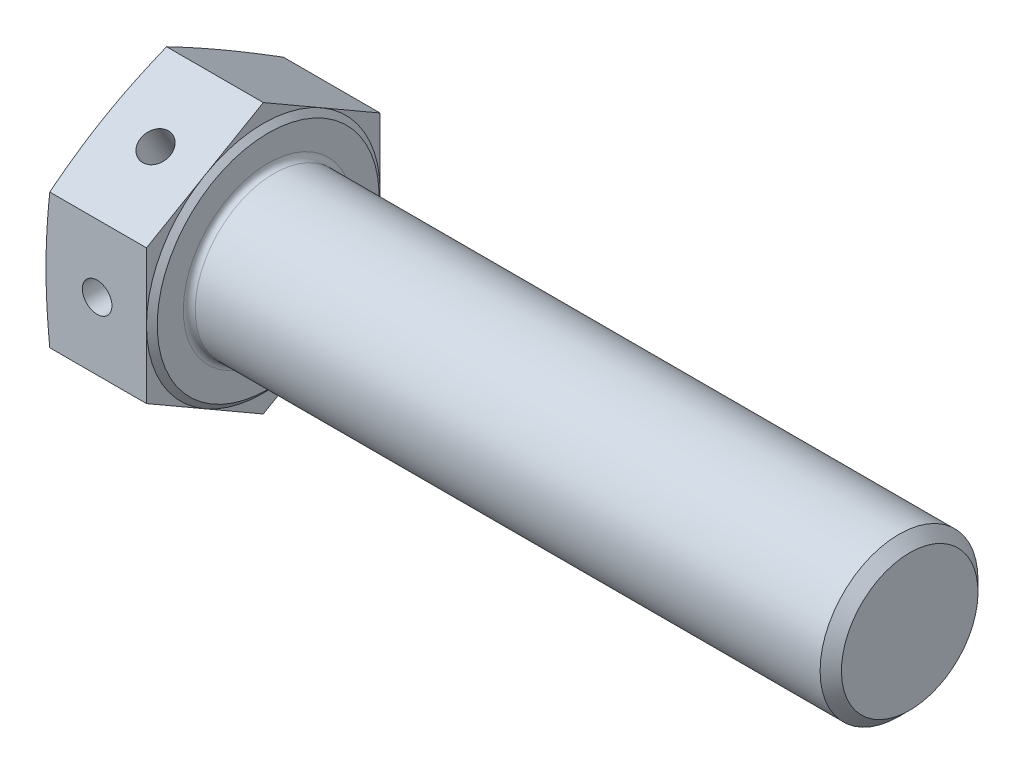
ISO-10303-21;
HEADER;
FILE_DESCRIPTION(('STEP AP214'),'2;1');
FILE_NAME('part.step','',(''),(''),'','','');
FILE_SCHEMA(('AUTOMOTIVE_DESIGN { 1 0 10303 214 1 1 1 1 }'));
ENDSEC;
DATA;
#1=APPLICATION_CONTEXT('core data for automotive mechanical design processes');
#2=APPLICATION_PROTOCOL_DEFINITION('international standard','automotive_design',2000,#1);
#3=PRODUCT_CONTEXT('',#1,'mechanical');
#4=PRODUCT('Part','Part','',(#3));
#5=PRODUCT_RELATED_PRODUCT_CATEGORY('part','',(#4));
#6=PRODUCT_DEFINITION_FORMATION('','',#4);
#7=PRODUCT_DEFINITION_CONTEXT('part definition',#1,'design');
#8=PRODUCT_DEFINITION('design','',#6,#7);
#9=PRODUCT_DEFINITION_SHAPE('','',#8);
#10=(LENGTH_UNIT() NAMED_UNIT(*) SI_UNIT(.MILLI.,.METRE.));
#11=(NAMED_UNIT(*) PLANE_ANGLE_UNIT() SI_UNIT($,.RADIAN.));
#12=(NAMED_UNIT(*) SI_UNIT($,.STERADIAN.) SOLID_ANGLE_UNIT());
#13=UNCERTAINTY_MEASURE_WITH_UNIT(LENGTH_MEASURE(1.E-05),#10,'distance_accuracy_value','');
#14=(GEOMETRIC_REPRESENTATION_CONTEXT(3) GLOBAL_UNCERTAINTY_ASSIGNED_CONTEXT((#13)) GLOBAL_UNIT_ASSIGNED_CONTEXT((#10,
#11,#12)) REPRESENTATION_CONTEXT('',''));
#15=CARTESIAN_POINT('',(0.,0.,0.));
#16=DIRECTION('',(0.,0.,1.));
#17=DIRECTION('',(1.,0.,0.));
#18=AXIS2_PLACEMENT_3D('',#15,#16,#17);
#19=CARTESIAN_POINT('',(5.18,0.,-11.835));
#20=DIRECTION('',(0.,0.,1.));
#21=DIRECTION('',(1.,0.,0.));
#22=AXIS2_PLACEMENT_3D('',#19,#20,#21);
#23=CYLINDRICAL_SURFACE('',#22,1.5);
#24=CARTESIAN_POINT('',(5.18,0.,11.835));
#25=DIRECTION('',(0.,0.,1.));
#26=DIRECTION('',(1.,0.,0.));
#27=AXIS2_PLACEMENT_3D('',#24,#25,#26);
#28=CIRCLE('',#27,1.5);
#29=CARTESIAN_POINT('',(6.68,0.,11.835));
#30=VERTEX_POINT('',#29);
#31=EDGE_CURVE('E584',#30,#30,#28,.T.);
#32=ORIENTED_EDGE('',*,*,#31,.T.);
#33=EDGE_LOOP('',(#32));
#34=FACE_BOUND('',#33,.T.);
#35=CARTESIAN_POINT('',(5.18,0.,0.));
#36=DIRECTION('',(0.,-0.866025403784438,0.500000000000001));
#37=DIRECTION('',(0.,0.500000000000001,0.866025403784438));
#38=AXIS2_PLACEMENT_3D('',#35,#36,#37);
#39=ELLIPSE('',#38,3.,1.5);
#40=CARTESIAN_POINT('',(3.68,0.,0.));
#41=VERTEX_POINT('',#40);
#42=CARTESIAN_POINT('',(6.68,0.,0.));
#43=VERTEX_POINT('',#42);
#44=EDGE_CURVE('E46',#41,#43,#39,.F.);
#45=ORIENTED_EDGE('',*,*,#44,.T.);
#46=CARTESIAN_POINT('',(5.18,0.,0.));
#47=DIRECTION('',(0.,0.500000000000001,0.866025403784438));
#48=DIRECTION('',(0.,-0.866025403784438,0.500000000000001));
#49=AXIS2_PLACEMENT_3D('',#46,#47,#48);
#50=ELLIPSE('',#49,1.73205080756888,1.5);
#51=EDGE_CURVE('E11',#43,#41,#50,.F.);
#52=ORIENTED_EDGE('',*,*,#51,.T.);
#53=EDGE_LOOP('',(#45,#52));
#54=FACE_BOUND('',#53,.T.);
#55=ADVANCED_FACE('F32',(#34,#54),#23,.F.);
#56=CARTESIAN_POINT('',(10.68,0.,0.));
#57=DIRECTION('',(-1.,0.,0.));
#58=DIRECTION('',(0.,-1.,0.));
#59=AXIS2_PLACEMENT_3D('',#56,#57,#58);
#60=PLANE('',#59);
#61=CARTESIAN_POINT('',(10.68,0.,0.));
#62=DIRECTION('',(-1.,0.,0.));
#63=DIRECTION('',(0.,-1.,0.));
#64=AXIS2_PLACEMENT_3D('',#61,#62,#63);
#65=CIRCLE('',#64,8.6);
#66=CARTESIAN_POINT('',(10.68,-8.6,0.));
#67=VERTEX_POINT('',#66);
#68=EDGE_CURVE('E137',#67,#67,#65,.T.);
#69=ORIENTED_EDGE('',*,*,#68,.T.);
#70=EDGE_LOOP('',(#69));
#71=FACE_BOUND('',#70,.T.);
#72=CARTESIAN_POINT('',(10.68,0.,0.));
#73=DIRECTION('',(-1.,0.,0.));
#74=DIRECTION('',(0.,-1.,0.));
#75=AXIS2_PLACEMENT_3D('',#72,#73,#74);
#76=CIRCLE('',#75,11.245);
#77=CARTESIAN_POINT('',(10.68,-11.245,0.));
#78=VERTEX_POINT('',#77);
#79=EDGE_CURVE('E284',#78,#78,#76,.T.);
#80=ORIENTED_EDGE('',*,*,#79,.F.);
#81=EDGE_LOOP('',(#80));
#82=FACE_BOUND('',#81,.T.);
#83=ADVANCED_FACE('F239',(#71,#82),#60,.F.);
#84=CARTESIAN_POINT('',(10.18,-20.4988213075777,-11.835));
#85=DIRECTION('',(1.,0.,0.));
#86=DIRECTION('',(0.,0.,-1.));
#87=AXIS2_PLACEMENT_3D('',#84,#85,#86);
#88=PLANE('',#87);
#89=DIRECTION('',(0.,-0.5,-0.866025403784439));
#90=VECTOR('',#89,1.);
#91=CARTESIAN_POINT('',(10.18,-6.83294043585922,11.835));
#92=LINE('',#91,#90);
#93=CARTESIAN_POINT('',(10.18,-6.83294043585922,11.835));
#94=VERTEX_POINT('',#93);
#95=CARTESIAN_POINT('',(10.18,-10.2494106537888,5.9175));
#96=VERTEX_POINT('',#95);
#97=EDGE_CURVE('E197',#94,#96,#92,.T.);
#98=ORIENTED_EDGE('',*,*,#97,.T.);
#99=CARTESIAN_POINT('',(10.18,0.,0.));
#100=DIRECTION('',(-1.,0.,0.));
#101=DIRECTION('',(0.,-1.,0.));
#102=AXIS2_PLACEMENT_3D('',#99,#100,#101);
#103=CIRCLE('',#102,11.835);
#104=CARTESIAN_POINT('',(10.18,0.,11.835));
#105=VERTEX_POINT('',#104);
#106=EDGE_CURVE('E54',#96,#105,#103,.T.);
#107=ORIENTED_EDGE('',*,*,#106,.T.);
#108=DIRECTION('',(0.,-1.,0.));
#109=VECTOR('',#108,1.);
#110=CARTESIAN_POINT('',(10.18,6.83294043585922,11.835));
#111=LINE('',#110,#109);
#112=EDGE_CURVE('E180',#105,#94,#111,.T.);
#113=ORIENTED_EDGE('',*,*,#112,.T.);
#114=EDGE_LOOP('',(#98,#107,#113));
#115=FACE_BOUND('',#114,.T.);
#116=ADVANCED_FACE('F245',(#115),#88,.T.);
#117=CARTESIAN_POINT('',(10.18,6.83294043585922,11.835));
#118=VERTEX_POINT('',#117);
#119=EDGE_CURVE('E177',#118,#105,#111,.T.);
#120=ORIENTED_EDGE('',*,*,#119,.T.);
#121=CARTESIAN_POINT('',(10.18,10.2494106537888,5.9175));
#122=VERTEX_POINT('',#121);
#123=EDGE_CURVE('E153',#105,#122,#103,.T.);
#124=ORIENTED_EDGE('',*,*,#123,.T.);
#125=DIRECTION('',(0.,-0.5,0.866025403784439));
#126=VECTOR('',#125,1.);
#127=CARTESIAN_POINT('',(10.18,13.6658808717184,0.));
#128=LINE('',#127,#126);
#129=EDGE_CURVE('E184',#122,#118,#128,.T.);
#130=ORIENTED_EDGE('',*,*,#129,.T.);
#131=EDGE_LOOP('',(#120,#124,#130));
#132=FACE_BOUND('',#131,.T.);
#133=ADVANCED_FACE('F341',(#132),#88,.T.);
#134=CARTESIAN_POINT('',(10.18,13.6658808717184,0.));
#135=VERTEX_POINT('',#134);
#136=EDGE_CURVE('E181',#135,#122,#128,.T.);
#137=ORIENTED_EDGE('',*,*,#136,.T.);
#138=CARTESIAN_POINT('',(10.18,10.2494106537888,-5.9175));
#139=VERTEX_POINT('',#138);
#140=EDGE_CURVE('E346',#122,#139,#103,.T.);
#141=ORIENTED_EDGE('',*,*,#140,.T.);
#142=DIRECTION('',(0.,0.5,0.866025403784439));
#143=VECTOR('',#142,1.);
#144=CARTESIAN_POINT('',(10.18,6.83294043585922,-11.835));
#145=LINE('',#144,#143);
#146=EDGE_CURVE('E188',#139,#135,#145,.T.);
#147=ORIENTED_EDGE('',*,*,#146,.T.);
#148=EDGE_LOOP('',(#137,#141,#147));
#149=FACE_BOUND('',#148,.T.);
#150=ADVANCED_FACE('F345',(#149),#88,.T.);
#151=CARTESIAN_POINT('',(10.18,6.83294043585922,-11.835));
#152=VERTEX_POINT('',#151);
#153=EDGE_CURVE('E185',#152,#139,#145,.T.);
#154=ORIENTED_EDGE('',*,*,#153,.T.);
#155=CARTESIAN_POINT('',(10.18,0.,-11.835));
#156=VERTEX_POINT('',#155);
#157=EDGE_CURVE('E405',#139,#156,#103,.T.);
#158=ORIENTED_EDGE('',*,*,#157,.T.);
#159=DIRECTION('',(0.,1.,0.));
#160=VECTOR('',#159,1.);
#161=CARTESIAN_POINT('',(10.18,-6.83294043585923,-11.835));
#162=LINE('',#161,#160);
#163=EDGE_CURVE('E192',#156,#152,#162,.T.);
#164=ORIENTED_EDGE('',*,*,#163,.T.);
#165=EDGE_LOOP('',(#154,#158,#164));
#166=FACE_BOUND('',#165,.T.);
#167=ADVANCED_FACE('F398',(#166),#88,.T.);
#168=CARTESIAN_POINT('',(10.18,-6.83294043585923,-11.835));
#169=VERTEX_POINT('',#168);
#170=EDGE_CURVE('E189',#169,#156,#162,.T.);
#171=ORIENTED_EDGE('',*,*,#170,.T.);
#172=CARTESIAN_POINT('',(10.18,-10.2494106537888,-5.9175));
#173=VERTEX_POINT('',#172);
#174=EDGE_CURVE('E403',#156,#173,#103,.T.);
#175=ORIENTED_EDGE('',*,*,#174,.T.);
#176=DIRECTION('',(0.,0.5,-0.866025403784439));
#177=VECTOR('',#176,1.);
#178=CARTESIAN_POINT('',(10.18,-13.6658808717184,0.));
#179=LINE('',#178,#177);
#180=EDGE_CURVE('E196',#173,#169,#179,.T.);
#181=ORIENTED_EDGE('',*,*,#180,.T.);
#182=EDGE_LOOP('',(#171,#175,#181));
#183=FACE_BOUND('',#182,.T.);
#184=ADVANCED_FACE('F393',(#183),#88,.T.);
#185=CARTESIAN_POINT('',(10.18,-13.6658808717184,0.));
#186=VERTEX_POINT('',#185);
#187=EDGE_CURVE('E193',#186,#173,#179,.T.);
#188=ORIENTED_EDGE('',*,*,#187,.T.);
#189=EDGE_CURVE('E292',#173,#96,#103,.T.);
#190=ORIENTED_EDGE('',*,*,#189,.T.);
#191=EDGE_CURVE('E200',#96,#186,#92,.T.);
#192=ORIENTED_EDGE('',*,*,#191,.T.);
#193=EDGE_LOOP('',(#188,#190,#192));
#194=FACE_BOUND('',#193,.T.);
#195=ADVANCED_FACE('F234',(#194),#88,.T.);
#196=CARTESIAN_POINT('',(10.18,-6.83294043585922,11.835));
#197=DIRECTION('',(0.,0.866025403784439,-0.5));
#198=DIRECTION('',(0.,0.5,0.866025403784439));
#199=AXIS2_PLACEMENT_3D('',#196,#197,#198);
#200=PLANE('',#199);
#201=CARTESIAN_POINT('',(0.38368252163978,-13.6659963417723,-0.000199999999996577));
#202=CARTESIAN_POINT('',(0.324118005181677,-13.3818649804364,0.491929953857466));
#203=CARTESIAN_POINT('',(0.270094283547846,-13.0974164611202,0.984609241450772));
#204=CARTESIAN_POINT('',(0.175240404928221,-12.527904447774,1.97103298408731));
#205=CARTESIAN_POINT('',(0.134413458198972,-12.2428408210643,2.46477766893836));
#206=CARTESIAN_POINT('',(0.068201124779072,-11.6731595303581,3.4514946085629));
#207=CARTESIAN_POINT('',(0.04276725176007,-11.3885433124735,3.94446435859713));
#208=CARTESIAN_POINT('',(0.00866765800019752,-10.8190882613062,4.93078943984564));
#209=CARTESIAN_POINT('',(0.,-10.5342494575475,5.42414471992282));
#210=CARTESIAN_POINT('',(0.,-9.96457185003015,6.41085528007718));
#211=CARTESIAN_POINT('',(0.00866765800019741,-9.67973304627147,6.90421056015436));
#212=CARTESIAN_POINT('',(0.0427672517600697,-9.11027799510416,7.89053564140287));
#213=CARTESIAN_POINT('',(0.0682011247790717,-8.82566177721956,8.3835053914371));
#214=CARTESIAN_POINT('',(0.134413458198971,-8.25598048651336,9.37022233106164));
#215=CARTESIAN_POINT('',(0.17524040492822,-7.97091685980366,9.86396701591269));
#216=CARTESIAN_POINT('',(0.270094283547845,-7.40140484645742,10.8503907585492));
#217=CARTESIAN_POINT('',(0.324118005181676,-7.11695632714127,11.3430700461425));
#218=CARTESIAN_POINT('',(0.383682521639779,-6.83282496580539,11.8352));
#219=B_SPLINE_CURVE_WITH_KNOTS('',3,(#201,#202,#203,#204,#205,#206,#207,#208,#209,#210,#211,
#212,#213,#214,#215,#216,#217,#218),.UNSPECIFIED.,.F.,.F.,(4,2,2,2,2,2,2,2,4),(0.,
1.71418095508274,3.4287785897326,5.13794695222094,6.84691781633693,8.55588868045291,
10.2650570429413,11.9796546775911,13.6938356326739),.UNSPECIFIED.);
#220=CARTESIAN_POINT('',(0.383658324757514,-13.6658808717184,0.));
#221=VERTEX_POINT('',#220);
#222=CARTESIAN_POINT('',(0.,-10.2494106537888,5.91749999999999));
#223=VERTEX_POINT('',#222);
#224=EDGE_CURVE('E356',#221,#223,#219,.T.);
#225=ORIENTED_EDGE('',*,*,#224,.F.);
#226=DIRECTION('',(-1.,0.,0.));
#227=VECTOR('',#226,1.);
#228=CARTESIAN_POINT('',(10.18,-13.6658808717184,0.));
#229=LINE('',#228,#227);
#230=EDGE_CURVE('E158',#186,#221,#229,.T.);
#231=ORIENTED_EDGE('',*,*,#230,.F.);
#232=ORIENTED_EDGE('',*,*,#191,.F.);
#233=ORIENTED_EDGE('',*,*,#97,.F.);
#234=DIRECTION('',(-1.,0.,0.));
#235=VECTOR('',#234,1.);
#236=CARTESIAN_POINT('',(10.18,-6.83294043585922,11.835));
#237=LINE('',#236,#235);
#238=CARTESIAN_POINT('',(0.383658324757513,-6.83294043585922,11.835));
#239=VERTEX_POINT('',#238);
#240=EDGE_CURVE('E174',#94,#239,#237,.T.);
#241=ORIENTED_EDGE('',*,*,#240,.T.);
#242=EDGE_CURVE('E333',#223,#239,#219,.T.);
#243=ORIENTED_EDGE('',*,*,#242,.F.);
#244=EDGE_LOOP('',(#225,#231,#232,#233,#241,#243));
#245=FACE_BOUND('',#244,.T.);
#246=ADVANCED_FACE('F34',(#245),#200,.F.);
#247=CARTESIAN_POINT('',(10.18,-13.6658808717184,0.));
#248=DIRECTION('',(0.,0.866025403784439,0.5));
#249=DIRECTION('',(0.,-0.5,0.866025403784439));
#250=AXIS2_PLACEMENT_3D('',#247,#248,#249);
#251=PLANE('',#250);
#252=CARTESIAN_POINT('',(5.18,-10.2494106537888,-5.91749999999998));
#253=DIRECTION('',(0.,0.866025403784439,0.5));
#254=DIRECTION('',(0.,-0.5,0.866025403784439));
#255=AXIS2_PLACEMENT_3D('',#252,#253,#254);
#256=CIRCLE('',#255,1.5);
#257=CARTESIAN_POINT('',(5.18,-10.9994106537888,-4.61846189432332));
#258=VERTEX_POINT('',#257);
#259=EDGE_CURVE('E582',#258,#258,#256,.T.);
#260=ORIENTED_EDGE('',*,*,#259,.T.);
#261=EDGE_LOOP('',(#260));
#262=FACE_BOUND('',#261,.T.);
#263=CARTESIAN_POINT('',(0.383682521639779,-6.83282496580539,-11.8352));
#264=CARTESIAN_POINT('',(0.324118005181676,-7.11695632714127,-11.3430700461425));
#265=CARTESIAN_POINT('',(0.270094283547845,-7.40140484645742,-10.8503907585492));
#266=CARTESIAN_POINT('',(0.17524040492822,-7.97091685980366,-9.86396701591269));
#267=CARTESIAN_POINT('',(0.134413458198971,-8.25598048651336,-9.37022233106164));
#268=CARTESIAN_POINT('',(0.0682011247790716,-8.82566177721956,-8.3835053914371));
#269=CARTESIAN_POINT('',(0.0427672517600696,-9.11027799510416,-7.89053564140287));
#270=CARTESIAN_POINT('',(0.00866765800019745,-9.67973304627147,-6.90421056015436));
#271=CARTESIAN_POINT('',(0.,-9.96457185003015,-6.41085528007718));
#272=CARTESIAN_POINT('',(0.,-10.5342494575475,-5.42414471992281));
#273=CARTESIAN_POINT('',(0.00866765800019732,-10.8190882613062,-4.93078943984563));
#274=CARTESIAN_POINT('',(0.0427672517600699,-11.3885433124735,-3.94446435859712));
#275=CARTESIAN_POINT('',(0.0682011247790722,-11.6731595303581,-3.45149460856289));
#276=CARTESIAN_POINT('',(0.134413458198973,-12.2428408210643,-2.46477766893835));
#277=CARTESIAN_POINT('',(0.175240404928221,-12.527904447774,-1.9710329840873));
#278=CARTESIAN_POINT('',(0.270094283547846,-13.0974164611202,-0.984609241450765));
#279=CARTESIAN_POINT('',(0.324118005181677,-13.3818649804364,-0.491929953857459));
#280=CARTESIAN_POINT('',(0.38368252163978,-13.6659963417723,0.000200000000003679));
#281=B_SPLINE_CURVE_WITH_KNOTS('',3,(#263,#264,#265,#266,#267,#268,#269,#270,#271,#272,#273,
#274,#275,#276,#277,#278,#279,#280),.UNSPECIFIED.,.F.,.F.,(4,2,2,2,2,2,2,2,4),(0.,
1.71418095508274,3.4287785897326,5.13794695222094,6.84691781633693,8.55588868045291,
10.2650570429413,11.9796546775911,13.6938356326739),.UNSPECIFIED.);
#282=CARTESIAN_POINT('',(0.383658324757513,-6.83294043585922,-11.835));
#283=VERTEX_POINT('',#282);
#284=CARTESIAN_POINT('',(0.,-10.2494106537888,-5.9175));
#285=VERTEX_POINT('',#284);
#286=EDGE_CURVE('E355',#283,#285,#281,.T.);
#287=ORIENTED_EDGE('',*,*,#286,.F.);
#288=DIRECTION('',(-1.,0.,0.));
#289=VECTOR('',#288,1.);
#290=CARTESIAN_POINT('',(10.18,-6.83294043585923,-11.835));
#291=LINE('',#290,#289);
#292=EDGE_CURVE('E162',#169,#283,#291,.T.);
#293=ORIENTED_EDGE('',*,*,#292,.F.);
#294=ORIENTED_EDGE('',*,*,#180,.F.);
#295=ORIENTED_EDGE('',*,*,#187,.F.);
#296=ORIENTED_EDGE('',*,*,#230,.T.);
#297=EDGE_CURVE('E210',#285,#221,#281,.T.);
#298=ORIENTED_EDGE('',*,*,#297,.F.);
#299=EDGE_LOOP('',(#287,#293,#294,#295,#296,#298));
#300=FACE_BOUND('',#299,.T.);
#301=ADVANCED_FACE('F224',(#262,#300),#251,.F.);
#302=CARTESIAN_POINT('',(10.18,-6.83294043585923,-11.835));
#303=DIRECTION('',(0.,0.,1.));
#304=DIRECTION('',(0.,-1.,0.));
#305=AXIS2_PLACEMENT_3D('',#302,#303,#304);
#306=PLANE('',#305);
#307=CARTESIAN_POINT('',(5.18,0.,-11.835));
#308=DIRECTION('',(0.,0.,1.));
#309=DIRECTION('',(1.,0.,0.));
#310=AXIS2_PLACEMENT_3D('',#307,#308,#309);
#311=CIRCLE('',#310,1.5);
#312=CARTESIAN_POINT('',(6.68,0.,-11.835));
#313=VERTEX_POINT('',#312);
#314=EDGE_CURVE('E290',#313,#313,#311,.T.);
#315=ORIENTED_EDGE('',*,*,#314,.T.);
#316=EDGE_LOOP('',(#315));
#317=FACE_BOUND('',#316,.T.);
#318=CARTESIAN_POINT('',(2.04291441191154,-18.0501307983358,-11.835));
#319=CARTESIAN_POINT('',(1.94882996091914,-17.5130968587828,-11.835));
#320=CARTESIAN_POINT('',(1.85592371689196,-16.9758527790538,-11.835));
#321=CARTESIAN_POINT('',(1.67309508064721,-15.9008428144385,-11.835));
#322=CARTESIAN_POINT('',(1.58317276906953,-15.3630769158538,-11.835));
#323=CARTESIAN_POINT('',(1.40689155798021,-14.2866269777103,-11.835));
#324=CARTESIAN_POINT('',(1.32053483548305,-13.7479425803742,-11.835));
#325=CARTESIAN_POINT('',(1.15228280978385,-12.6698779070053,-11.835));
#326=CARTESIAN_POINT('',(1.07038748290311,-12.1304976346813,-11.835));
#327=CARTESIAN_POINT('',(0.912478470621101,-11.0535029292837,-11.835));
#328=CARTESIAN_POINT('',(0.836438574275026,-10.5158923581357,-11.835));
#329=CARTESIAN_POINT('',(0.691087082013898,-9.4397639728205,-11.835));
#330=CARTESIAN_POINT('',(0.621775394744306,-8.90124617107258,-11.835));
#331=CARTESIAN_POINT('',(0.491422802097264,-7.8232453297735,-11.835));
#332=CARTESIAN_POINT('',(0.43038124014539,-7.28376237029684,-11.835));
#333=CARTESIAN_POINT('',(0.318338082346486,-6.20374352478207,-11.835));
#334=CARTESIAN_POINT('',(0.267336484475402,-5.66320763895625,-11.835));
#335=CARTESIAN_POINT('',(0.176973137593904,-4.57747867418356,-11.835));
#336=CARTESIAN_POINT('',(0.137692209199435,-4.03227877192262,-11.835));
#337=CARTESIAN_POINT('',(0.0730761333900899,-2.94104599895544,-11.835));
#338=CARTESIAN_POINT('',(0.0477408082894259,-2.39501313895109,-11.835));
#339=CARTESIAN_POINT('',(0.0124139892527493,-1.30258571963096,-11.835));
#340=CARTESIAN_POINT('',(0.00241845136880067,-0.756191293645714,-11.835));
#341=CARTESIAN_POINT('',(-0.00163941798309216,0.336657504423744,-11.835));
#342=CARTESIAN_POINT('',(0.00429823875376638,0.883111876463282,-11.835));
#343=CARTESIAN_POINT('',(0.0317757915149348,1.97683171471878,-11.835));
#344=CARTESIAN_POINT('',(0.0533502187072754,2.5240962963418,-11.835));
#345=CARTESIAN_POINT('',(0.110911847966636,3.617859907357,-11.835));
#346=CARTESIAN_POINT('',(0.146899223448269,4.16435892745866,-11.835));
#347=CARTESIAN_POINT('',(0.231529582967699,5.25656682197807,-11.835));
#348=CARTESIAN_POINT('',(0.280177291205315,5.80227532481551,-11.835));
#349=CARTESIAN_POINT('',(0.388164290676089,6.89262217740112,-11.835));
#350=CARTESIAN_POINT('',(0.447503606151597,7.43726052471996,-11.835));
#351=CARTESIAN_POINT('',(0.571239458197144,8.49335727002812,-11.835));
#352=CARTESIAN_POINT('',(0.635130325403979,9.00487550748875,-11.835));
#353=CARTESIAN_POINT('',(0.769351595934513,10.0270706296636,-11.835));
#354=CARTESIAN_POINT('',(0.839682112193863,10.5377474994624,-11.835));
#355=CARTESIAN_POINT('',(0.985624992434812,11.5583763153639,-11.835));
#356=CARTESIAN_POINT('',(1.06123770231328,12.0683282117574,-11.835));
#357=CARTESIAN_POINT('',(1.21678601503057,13.0875668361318,-11.835));
#358=CARTESIAN_POINT('',(1.29672159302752,13.5968535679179,-11.835));
#359=CARTESIAN_POINT('',(1.46015698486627,14.6149521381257,-11.835));
#360=CARTESIAN_POINT('',(1.54365747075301,15.1237638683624,-11.835));
#361=CARTESIAN_POINT('',(1.7135915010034,16.1408980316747,-11.835));
#362=CARTESIAN_POINT('',(1.80002505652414,16.6492204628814,-11.835));
#363=CARTESIAN_POINT('',(2.06294205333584,18.173518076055,-11.835));
#364=CARTESIAN_POINT('',(2.24304905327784,19.1888680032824,-11.835));
#365=CARTESIAN_POINT('',(2.60890933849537,21.2122527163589,-11.835));
#366=CARTESIAN_POINT('',(2.7946222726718,22.2202948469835,-11.835));
#367=CARTESIAN_POINT('',(3.17087970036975,24.2354876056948,-11.835));
#368=CARTESIAN_POINT('',(3.36142425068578,25.242638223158,-11.835));
#369=CARTESIAN_POINT('',(3.74592520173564,27.2554087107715,-11.835));
#370=CARTESIAN_POINT('',(3.93987859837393,28.2610291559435,-11.835));
#371=CARTESIAN_POINT('',(4.23283790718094,29.7690539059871,-11.835));
#372=CARTESIAN_POINT('',(4.33082817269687,30.2716558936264,-11.835));
#373=CARTESIAN_POINT('',(4.52740724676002,31.2767424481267,-11.835));
#374=CARTESIAN_POINT('',(4.62599605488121,31.7792270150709,-11.835));
#375=CARTESIAN_POINT('',(4.72484494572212,32.2816604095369,-11.835));
#376=B_SPLINE_CURVE_WITH_KNOTS('',3,(#318,#319,#320,#321,#322,#323,#324,#325,#326,#327,#328,
#329,#330,#331,#332,#333,#334,#335,#336,#337,#338,#339,#340,#341,#342,#343,#344,#345,#346,#347,
#348,#349,#350,#351,#352,#353,#354,#355,#356,#357,#358,#359,#360,#361,#362,#363,#364,#365,#366,
#367,#368,#369,#370,#371,#372,#373,#374,#375),.UNSPECIFIED.,.F.,.F.,(4,2,2,2,2,2,2,2,2,2,2,2,2,
2,2,2,2,2,2,2,2,2,2,2,2,2,2,2,4),(0.,1.63564351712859,3.27133120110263,4.90800323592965,
6.54466658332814,8.17351699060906,9.80234527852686,11.4310441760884,13.0597427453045,
14.6994255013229,16.3390873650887,17.9783168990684,19.6175452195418,21.2604045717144,
22.9032836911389,24.5467767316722,26.1902734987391,27.7367040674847,29.2831617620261,
30.8297208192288,32.3762709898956,33.9231140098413,35.4699629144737,38.5635257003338,
41.6385312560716,44.7135729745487,47.7860286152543,49.3222241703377,50.8584186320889),.UNSPECIFIED.);
#377=CARTESIAN_POINT('',(0.383658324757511,6.83294043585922,-11.835));
#378=VERTEX_POINT('',#377);
#379=CARTESIAN_POINT('',(0.,0.,-11.835));
#380=VERTEX_POINT('',#379);
#381=EDGE_CURVE('E208',#378,#380,#376,.F.);
#382=ORIENTED_EDGE('',*,*,#381,.F.);
#383=DIRECTION('',(-1.,0.,0.));
#384=VECTOR('',#383,1.);
#385=CARTESIAN_POINT('',(10.18,6.83294043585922,-11.835));
#386=LINE('',#385,#384);
#387=EDGE_CURVE('E165',#152,#378,#386,.T.);
#388=ORIENTED_EDGE('',*,*,#387,.F.);
#389=ORIENTED_EDGE('',*,*,#163,.F.);
#390=ORIENTED_EDGE('',*,*,#170,.F.);
#391=ORIENTED_EDGE('',*,*,#292,.T.);
#392=EDGE_CURVE('E201',#380,#283,#376,.F.);
#393=ORIENTED_EDGE('',*,*,#392,.F.);
#394=EDGE_LOOP('',(#382,#388,#389,#390,#391,#393));
#395=FACE_BOUND('',#394,.T.);
#396=ADVANCED_FACE('F219',(#317,#395),#306,.F.);
#397=CARTESIAN_POINT('',(10.18,6.83294043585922,-11.835));
#398=DIRECTION('',(0.,-0.866025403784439,0.5));
#399=DIRECTION('',(0.,-0.5,-0.866025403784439));
#400=AXIS2_PLACEMENT_3D('',#397,#398,#399);
#401=PLANE('',#400);
#402=CARTESIAN_POINT('',(0.383682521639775,13.6659963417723,0.000199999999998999));
#403=CARTESIAN_POINT('',(0.324118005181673,13.3818649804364,-0.491929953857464));
#404=CARTESIAN_POINT('',(0.270094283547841,13.0974164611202,-0.98460924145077));
#405=CARTESIAN_POINT('',(0.175240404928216,12.527904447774,-1.97103298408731));
#406=CARTESIAN_POINT('',(0.134413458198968,12.2428408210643,-2.46477766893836));
#407=CARTESIAN_POINT('',(0.0682011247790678,11.6731595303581,-3.4514946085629));
#408=CARTESIAN_POINT('',(0.042767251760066,11.3885433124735,-3.94446435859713));
#409=CARTESIAN_POINT('',(0.00866765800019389,10.8190882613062,-4.93078943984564));
#410=CARTESIAN_POINT('',(0.,10.5342494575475,-5.42414471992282));
#411=CARTESIAN_POINT('',(0.,9.96457185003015,-6.41085528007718));
#412=CARTESIAN_POINT('',(0.00866765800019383,9.67973304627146,-6.90421056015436));
#413=CARTESIAN_POINT('',(0.0427672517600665,9.11027799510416,-7.89053564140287));
#414=CARTESIAN_POINT('',(0.0682011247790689,8.82566177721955,-8.3835053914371));
#415=CARTESIAN_POINT('',(0.134413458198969,8.25598048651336,-9.37022233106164));
#416=CARTESIAN_POINT('',(0.175240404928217,7.97091685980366,-9.86396701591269));
#417=CARTESIAN_POINT('',(0.270094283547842,7.40140484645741,-10.8503907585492));
#418=CARTESIAN_POINT('',(0.324118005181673,7.11695632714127,-11.3430700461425));
#419=CARTESIAN_POINT('',(0.383682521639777,6.83282496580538,-11.8352));
#420=B_SPLINE_CURVE_WITH_KNOTS('',3,(#402,#403,#404,#405,#406,#407,#408,#409,#410,#411,#412,
#413,#414,#415,#416,#417,#418,#419),.UNSPECIFIED.,.F.,.F.,(4,2,2,2,2,2,2,2,4),(0.,
1.71418095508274,3.4287785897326,5.13794695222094,6.84691781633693,8.55588868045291,
10.2650570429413,11.9796546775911,13.6938356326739),.UNSPECIFIED.);
#421=CARTESIAN_POINT('',(0.38365832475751,13.6658808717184,0.));
#422=VERTEX_POINT('',#421);
#423=CARTESIAN_POINT('',(0.,10.2494106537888,-5.9175));
#424=VERTEX_POINT('',#423);
#425=EDGE_CURVE('E352',#422,#424,#420,.T.);
#426=ORIENTED_EDGE('',*,*,#425,.F.);
#427=DIRECTION('',(-1.,0.,0.));
#428=VECTOR('',#427,1.);
#429=CARTESIAN_POINT('',(10.18,13.6658808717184,0.));
#430=LINE('',#429,#428);
#431=EDGE_CURVE('E168',#135,#422,#430,.T.);
#432=ORIENTED_EDGE('',*,*,#431,.F.);
#433=ORIENTED_EDGE('',*,*,#146,.F.);
#434=ORIENTED_EDGE('',*,*,#153,.F.);
#435=ORIENTED_EDGE('',*,*,#387,.T.);
#436=EDGE_CURVE('E209',#424,#378,#420,.T.);
#437=ORIENTED_EDGE('',*,*,#436,.F.);
#438=EDGE_LOOP('',(#426,#432,#433,#434,#435,#437));
#439=FACE_BOUND('',#438,.T.);
#440=ADVANCED_FACE('F223',(#439),#401,.F.);
#441=CARTESIAN_POINT('',(10.18,13.6658808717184,0.));
#442=DIRECTION('',(0.,-0.866025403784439,-0.5));
#443=DIRECTION('',(0.,0.5,-0.866025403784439));
#444=AXIS2_PLACEMENT_3D('',#441,#442,#443);
#445=PLANE('',#444);
#446=CARTESIAN_POINT('',(5.18,10.2494106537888,5.91749999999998));
#447=DIRECTION('',(0.,-0.866025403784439,-0.5));
#448=DIRECTION('',(0.,0.5,-0.866025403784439));
#449=AXIS2_PLACEMENT_3D('',#446,#447,#448);
#450=CIRCLE('',#449,1.5);
#451=CARTESIAN_POINT('',(5.18,10.9994106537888,4.61846189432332));
#452=VERTEX_POINT('',#451);
#453=EDGE_CURVE('E323',#452,#452,#450,.T.);
#454=ORIENTED_EDGE('',*,*,#453,.T.);
#455=EDGE_LOOP('',(#454));
#456=FACE_BOUND('',#455,.T.);
#457=CARTESIAN_POINT('',(0.383682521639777,6.83282496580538,11.8352));
#458=CARTESIAN_POINT('',(0.324118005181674,7.11695632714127,11.3430700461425));
#459=CARTESIAN_POINT('',(0.270094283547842,7.40140484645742,10.8503907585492));
#460=CARTESIAN_POINT('',(0.175240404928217,7.97091685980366,9.86396701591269));
#461=CARTESIAN_POINT('',(0.134413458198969,8.25598048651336,9.37022233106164));
#462=CARTESIAN_POINT('',(0.0682011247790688,8.82566177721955,8.3835053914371));
#463=CARTESIAN_POINT('',(0.0427672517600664,9.11027799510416,7.89053564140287));
#464=CARTESIAN_POINT('',(0.00866765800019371,9.67973304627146,6.90421056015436));
#465=CARTESIAN_POINT('',(0.,9.96457185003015,6.41085528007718));
#466=CARTESIAN_POINT('',(0.,10.5342494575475,5.42414471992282));
#467=CARTESIAN_POINT('',(0.00866765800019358,10.8190882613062,4.93078943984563));
#468=CARTESIAN_POINT('',(0.0427672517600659,11.3885433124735,3.94446435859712));
#469=CARTESIAN_POINT('',(0.0682011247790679,11.6731595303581,3.4514946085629));
#470=CARTESIAN_POINT('',(0.134413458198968,12.2428408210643,2.46477766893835));
#471=CARTESIAN_POINT('',(0.175240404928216,12.527904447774,1.9710329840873));
#472=CARTESIAN_POINT('',(0.270094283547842,13.0974164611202,0.984609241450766));
#473=CARTESIAN_POINT('',(0.324118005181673,13.3818649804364,0.491929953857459));
#474=CARTESIAN_POINT('',(0.383682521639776,13.6659963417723,-0.000200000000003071));
#475=B_SPLINE_CURVE_WITH_KNOTS('',3,(#457,#458,#459,#460,#461,#462,#463,#464,#465,#466,#467,
#468,#469,#470,#471,#472,#473,#474),.UNSPECIFIED.,.F.,.F.,(4,2,2,2,2,2,2,2,4),(0.,
1.71418095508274,3.4287785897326,5.13794695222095,6.84691781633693,8.55588868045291,
10.2650570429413,11.9796546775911,13.6938356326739),.UNSPECIFIED.);
#476=CARTESIAN_POINT('',(0.383658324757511,6.83294043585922,11.835));
#477=VERTEX_POINT('',#476);
#478=CARTESIAN_POINT('',(0.,10.2494106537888,5.91749999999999));
#479=VERTEX_POINT('',#478);
#480=EDGE_CURVE('E301',#477,#479,#475,.T.);
#481=ORIENTED_EDGE('',*,*,#480,.F.);
#482=DIRECTION('',(-1.,0.,0.));
#483=VECTOR('',#482,1.);
#484=CARTESIAN_POINT('',(10.18,6.83294043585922,11.835));
#485=LINE('',#484,#483);
#486=EDGE_CURVE('E171',#118,#477,#485,.T.);
#487=ORIENTED_EDGE('',*,*,#486,.F.);
#488=ORIENTED_EDGE('',*,*,#129,.F.);
#489=ORIENTED_EDGE('',*,*,#136,.F.);
#490=ORIENTED_EDGE('',*,*,#431,.T.);
#491=EDGE_CURVE('E329',#479,#422,#475,.T.);
#492=ORIENTED_EDGE('',*,*,#491,.F.);
#493=EDGE_LOOP('',(#481,#487,#488,#489,#490,#492));
#494=FACE_BOUND('',#493,.T.);
#495=ADVANCED_FACE('F311',(#456,#494),#445,.F.);
#496=CARTESIAN_POINT('',(10.18,6.83294043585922,11.835));
#497=DIRECTION('',(0.,0.,-1.));
#498=DIRECTION('',(-1.,0.,0.));
#499=AXIS2_PLACEMENT_3D('',#496,#497,#498);
#500=PLANE('',#499);
#501=ORIENTED_EDGE('',*,*,#31,.F.);
#502=EDGE_LOOP('',(#501));
#503=FACE_BOUND('',#502,.T.);
#504=CARTESIAN_POINT('',(2.04291441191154,-18.0501307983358,11.835));
#505=CARTESIAN_POINT('',(1.94882996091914,-17.5130968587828,11.835));
#506=CARTESIAN_POINT('',(1.85592371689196,-16.9758527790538,11.835));
#507=CARTESIAN_POINT('',(1.67309508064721,-15.9008428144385,11.835));
#508=CARTESIAN_POINT('',(1.58317276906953,-15.3630769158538,11.835));
#509=CARTESIAN_POINT('',(1.40689155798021,-14.2866269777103,11.835));
#510=CARTESIAN_POINT('',(1.32053483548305,-13.7479425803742,11.835));
#511=CARTESIAN_POINT('',(1.15228280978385,-12.6698779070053,11.835));
#512=CARTESIAN_POINT('',(1.07038748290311,-12.1304976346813,11.835));
#513=CARTESIAN_POINT('',(0.912478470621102,-11.0535029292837,11.835));
#514=CARTESIAN_POINT('',(0.836438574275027,-10.5158923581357,11.835));
#515=CARTESIAN_POINT('',(0.691087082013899,-9.4397639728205,11.835));
#516=CARTESIAN_POINT('',(0.621775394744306,-8.90124617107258,11.835));
#517=CARTESIAN_POINT('',(0.491422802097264,-7.8232453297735,11.835));
#518=CARTESIAN_POINT('',(0.430381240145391,-7.28376237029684,11.835));
#519=CARTESIAN_POINT('',(0.318338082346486,-6.20374352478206,11.835));
#520=CARTESIAN_POINT('',(0.267336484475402,-5.66320763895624,11.835));
#521=CARTESIAN_POINT('',(0.176973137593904,-4.57747867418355,11.835));
#522=CARTESIAN_POINT('',(0.137692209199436,-4.03227877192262,11.835));
#523=CARTESIAN_POINT('',(0.0730761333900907,-2.94104599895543,11.835));
#524=CARTESIAN_POINT('',(0.0477408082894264,-2.39501313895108,11.835));
#525=CARTESIAN_POINT('',(0.0124139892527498,-1.30258571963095,11.835));
#526=CARTESIAN_POINT('',(0.00241845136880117,-0.756191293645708,11.835));
#527=CARTESIAN_POINT('',(-0.00163941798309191,0.33665750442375,11.835));
#528=CARTESIAN_POINT('',(0.00429823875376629,0.883111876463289,11.835));
#529=CARTESIAN_POINT('',(0.0317757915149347,1.97683171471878,11.835));
#530=CARTESIAN_POINT('',(0.0533502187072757,2.52409629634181,11.835));
#531=CARTESIAN_POINT('',(0.110911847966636,3.61785990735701,11.835));
#532=CARTESIAN_POINT('',(0.14689922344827,4.16435892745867,11.835));
#533=CARTESIAN_POINT('',(0.2315295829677,5.25656682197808,11.835));
#534=CARTESIAN_POINT('',(0.280177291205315,5.80227532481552,11.835));
#535=CARTESIAN_POINT('',(0.388164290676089,6.89262217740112,11.835));
#536=CARTESIAN_POINT('',(0.447503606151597,7.43726052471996,11.835));
#537=CARTESIAN_POINT('',(0.571239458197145,8.49335727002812,11.835));
#538=CARTESIAN_POINT('',(0.635130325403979,9.00487550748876,11.835));
#539=CARTESIAN_POINT('',(0.769351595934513,10.0270706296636,11.835));
#540=CARTESIAN_POINT('',(0.839682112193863,10.5377474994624,11.835));
#541=CARTESIAN_POINT('',(0.985624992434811,11.5583763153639,11.835));
#542=CARTESIAN_POINT('',(1.06123770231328,12.0683282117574,11.835));
#543=CARTESIAN_POINT('',(1.21678601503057,13.0875668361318,11.835));
#544=CARTESIAN_POINT('',(1.29672159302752,13.5968535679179,11.835));
#545=CARTESIAN_POINT('',(1.46015698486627,14.6149521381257,11.835));
#546=CARTESIAN_POINT('',(1.54365747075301,15.1237638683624,11.835));
#547=CARTESIAN_POINT('',(1.7135915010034,16.1408980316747,11.835));
#548=CARTESIAN_POINT('',(1.80002505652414,16.6492204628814,11.835));
#549=CARTESIAN_POINT('',(2.06294205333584,18.173518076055,11.835));
#550=CARTESIAN_POINT('',(2.24304905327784,19.1888680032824,11.835));
#551=CARTESIAN_POINT('',(2.60890933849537,21.2122527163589,11.835));
#552=CARTESIAN_POINT('',(2.79462227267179,22.2202948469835,11.835));
#553=CARTESIAN_POINT('',(3.17087970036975,24.2354876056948,11.835));
#554=CARTESIAN_POINT('',(3.36142425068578,25.242638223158,11.835));
#555=CARTESIAN_POINT('',(3.74592520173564,27.2554087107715,11.835));
#556=CARTESIAN_POINT('',(3.93987859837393,28.2610291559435,11.835));
#557=CARTESIAN_POINT('',(4.23283790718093,29.7690539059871,11.835));
#558=CARTESIAN_POINT('',(4.33082817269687,30.2716558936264,11.835));
#559=CARTESIAN_POINT('',(4.52740724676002,31.2767424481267,11.835));
#560=CARTESIAN_POINT('',(4.6259960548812,31.7792270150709,11.835));
#561=CARTESIAN_POINT('',(4.72484494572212,32.2816604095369,11.835));
#562=B_SPLINE_CURVE_WITH_KNOTS('',3,(#504,#505,#506,#507,#508,#509,#510,#511,#512,#513,#514,
#515,#516,#517,#518,#519,#520,#521,#522,#523,#524,#525,#526,#527,#528,#529,#530,#531,#532,#533,
#534,#535,#536,#537,#538,#539,#540,#541,#542,#543,#544,#545,#546,#547,#548,#549,#550,#551,#552,
#553,#554,#555,#556,#557,#558,#559,#560,#561),.UNSPECIFIED.,.F.,.F.,(4,2,2,2,2,2,2,2,2,2,2,2,2,
2,2,2,2,2,2,2,2,2,2,2,2,2,2,2,4),(0.,1.63564351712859,3.27133120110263,4.90800323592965,
6.54466658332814,8.17351699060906,9.80234527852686,11.4310441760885,13.0597427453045,
14.6994255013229,16.3390873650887,17.9783168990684,19.6175452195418,21.2604045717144,
22.9032836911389,24.5467767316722,26.1902734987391,27.7367040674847,29.2831617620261,
30.8297208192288,32.3762709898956,33.9231140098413,35.4699629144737,38.5635257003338,
41.6385312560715,44.7135729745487,47.7860286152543,49.3222241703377,50.8584186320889),.UNSPECIFIED.);
#563=CARTESIAN_POINT('',(0.,0.,11.835));
#564=VERTEX_POINT('',#563);
#565=EDGE_CURVE('E300',#239,#564,#562,.T.);
#566=ORIENTED_EDGE('',*,*,#565,.F.);
#567=ORIENTED_EDGE('',*,*,#240,.F.);
#568=ORIENTED_EDGE('',*,*,#112,.F.);
#569=ORIENTED_EDGE('',*,*,#119,.F.);
#570=ORIENTED_EDGE('',*,*,#486,.T.);
#571=EDGE_CURVE('E288',#564,#477,#562,.T.);
#572=ORIENTED_EDGE('',*,*,#571,.F.);
#573=EDGE_LOOP('',(#566,#567,#568,#569,#570,#572));
#574=FACE_BOUND('',#573,.T.);
#575=ADVANCED_FACE('F306',(#503,#574),#500,.F.);
#576=CARTESIAN_POINT('',(0.,0.,0.));
#577=DIRECTION('',(1.,0.,0.));
#578=DIRECTION('',(0.,1.,0.));
#579=AXIS2_PLACEMENT_3D('',#576,#577,#578);
#580=CONICAL_SURFACE('',#579,11.835,1.36423660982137);
#581=ORIENTED_EDGE('',*,*,#392,.T.);
#582=ORIENTED_EDGE('',*,*,#286,.T.);
#583=CARTESIAN_POINT('',(0.,0.,0.));
#584=DIRECTION('',(1.,0.,0.));
#585=DIRECTION('',(0.,0.,-1.));
#586=AXIS2_PLACEMENT_3D('',#583,#584,#585);
#587=CIRCLE('',#586,11.835);
#588=EDGE_CURVE('E154',#285,#380,#587,.T.);
#589=ORIENTED_EDGE('',*,*,#588,.T.);
#590=EDGE_LOOP('',(#581,#582,#589));
#591=FACE_BOUND('',#590,.T.);
#592=ADVANCED_FACE('F310',(#591),#580,.T.);
#593=ORIENTED_EDGE('',*,*,#297,.T.);
#594=ORIENTED_EDGE('',*,*,#224,.T.);
#595=EDGE_CURVE('E157',#223,#285,#587,.T.);
#596=ORIENTED_EDGE('',*,*,#595,.T.);
#597=EDGE_LOOP('',(#593,#594,#596));
#598=FACE_BOUND('',#597,.T.);
#599=ADVANCED_FACE('F377',(#598),#580,.T.);
#600=ORIENTED_EDGE('',*,*,#242,.T.);
#601=ORIENTED_EDGE('',*,*,#565,.T.);
#602=CARTESIAN_POINT('',(0.,0.,0.));
#603=DIRECTION('',(-1.,0.,0.));
#604=DIRECTION('',(0.,-1.,0.));
#605=AXIS2_PLACEMENT_3D('',#602,#603,#604);
#606=CIRCLE('',#605,11.835);
#607=EDGE_CURVE('E286',#223,#564,#606,.T.);
#608=ORIENTED_EDGE('',*,*,#607,.F.);
#609=EDGE_LOOP('',(#600,#601,#608));
#610=FACE_BOUND('',#609,.T.);
#611=ADVANCED_FACE('F385',(#610),#580,.T.);
#612=ORIENTED_EDGE('',*,*,#480,.T.);
#613=EDGE_CURVE('E407',#479,#564,#587,.T.);
#614=ORIENTED_EDGE('',*,*,#613,.T.);
#615=ORIENTED_EDGE('',*,*,#571,.T.);
#616=EDGE_LOOP('',(#612,#614,#615));
#617=FACE_BOUND('',#616,.T.);
#618=ADVANCED_FACE('F409',(#617),#580,.T.);
#619=ORIENTED_EDGE('',*,*,#425,.T.);
#620=EDGE_CURVE('E406',#424,#479,#587,.T.);
#621=ORIENTED_EDGE('',*,*,#620,.T.);
#622=ORIENTED_EDGE('',*,*,#491,.T.);
#623=EDGE_LOOP('',(#619,#621,#622));
#624=FACE_BOUND('',#623,.T.);
#625=ADVANCED_FACE('F411',(#624),#580,.T.);
#626=ORIENTED_EDGE('',*,*,#381,.T.);
#627=EDGE_CURVE('E159',#380,#424,#587,.T.);
#628=ORIENTED_EDGE('',*,*,#627,.T.);
#629=ORIENTED_EDGE('',*,*,#436,.T.);
#630=EDGE_LOOP('',(#626,#628,#629));
#631=FACE_BOUND('',#630,.T.);
#632=ADVANCED_FACE('F215',(#631),#580,.T.);
#633=CARTESIAN_POINT('',(0.,-20.4988213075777,-11.835));
#634=DIRECTION('',(1.,0.,0.));
#635=DIRECTION('',(0.,0.,-1.));
#636=AXIS2_PLACEMENT_3D('',#633,#634,#635);
#637=PLANE('',#636);
#638=ORIENTED_EDGE('',*,*,#627,.F.);
#639=ORIENTED_EDGE('',*,*,#588,.F.);
#640=ORIENTED_EDGE('',*,*,#595,.F.);
#641=ORIENTED_EDGE('',*,*,#607,.T.);
#642=ORIENTED_EDGE('',*,*,#613,.F.);
#643=ORIENTED_EDGE('',*,*,#620,.F.);
#644=EDGE_LOOP('',(#638,#639,#640,#641,#642,#643));
#645=FACE_BOUND('',#644,.T.);
#646=ADVANCED_FACE('F276',(#645),#637,.F.);
#647=CARTESIAN_POINT('',(10.68,0.,0.));
#648=DIRECTION('',(-1.,0.,0.));
#649=DIRECTION('',(0.,-1.,0.));
#650=AXIS2_PLACEMENT_3D('',#647,#648,#649);
#651=CONICAL_SURFACE('',#650,11.245,0.867780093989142);
#652=ORIENTED_EDGE('',*,*,#106,.F.);
#653=ORIENTED_EDGE('',*,*,#189,.F.);
#654=ORIENTED_EDGE('',*,*,#174,.F.);
#655=ORIENTED_EDGE('',*,*,#157,.F.);
#656=ORIENTED_EDGE('',*,*,#140,.F.);
#657=ORIENTED_EDGE('',*,*,#123,.F.);
#658=EDGE_LOOP('',(#652,#653,#654,#655,#656,#657));
#659=FACE_BOUND('',#658,.T.);
#660=ORIENTED_EDGE('',*,*,#79,.T.);
#661=EDGE_LOOP('',(#660));
#662=FACE_BOUND('',#661,.T.);
#663=ADVANCED_FACE('F273',(#659,#662),#651,.T.);
#664=CARTESIAN_POINT('',(75.68,0.,0.));
#665=DIRECTION('',(-1.,0.,0.));
#666=DIRECTION('',(0.,-1.,0.));
#667=AXIS2_PLACEMENT_3D('',#664,#665,#666);
#668=CYLINDRICAL_SURFACE('',#667,8.);
#669=CARTESIAN_POINT('',(11.28,0.,0.));
#670=DIRECTION('',(-1.,0.,0.));
#671=DIRECTION('',(0.,-1.,0.));
#672=AXIS2_PLACEMENT_3D('',#669,#670,#671);
#673=CIRCLE('',#672,8.);
#674=CARTESIAN_POINT('',(11.28,-8.,0.));
#675=VERTEX_POINT('',#674);
#676=EDGE_CURVE('E144',#675,#675,#673,.F.);
#677=ORIENTED_EDGE('',*,*,#676,.T.);
#678=EDGE_LOOP('',(#677));
#679=FACE_BOUND('',#678,.T.);
#680=CARTESIAN_POINT('',(74.5975,0.,0.));
#681=DIRECTION('',(1.,0.,0.));
#682=DIRECTION('',(0.,1.,0.));
#683=AXIS2_PLACEMENT_3D('',#680,#681,#682);
#684=CIRCLE('',#683,8.);
#685=CARTESIAN_POINT('',(74.5975,8.00000000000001,0.));
#686=VERTEX_POINT('',#685);
#687=EDGE_CURVE('E147',#686,#686,#684,.F.);
#688=ORIENTED_EDGE('',*,*,#687,.T.);
#689=EDGE_LOOP('',(#688));
#690=FACE_BOUND('',#689,.T.);
#691=ADVANCED_FACE('F269',(#679,#690),#668,.T.);
#692=CARTESIAN_POINT('',(75.68,0.,0.));
#693=DIRECTION('',(1.,0.,0.));
#694=DIRECTION('',(0.,1.,0.));
#695=AXIS2_PLACEMENT_3D('',#692,#693,#694);
#696=PLANE('',#695);
#697=CARTESIAN_POINT('',(75.68,0.,0.));
#698=DIRECTION('',(1.,0.,0.));
#699=DIRECTION('',(0.,1.,0.));
#700=AXIS2_PLACEMENT_3D('',#697,#698,#699);
#701=CIRCLE('',#700,6.91750000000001);
#702=CARTESIAN_POINT('',(75.68,6.91750000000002,0.));
#703=VERTEX_POINT('',#702);
#704=EDGE_CURVE('E150',#703,#703,#701,.T.);
#705=ORIENTED_EDGE('',*,*,#704,.T.);
#706=EDGE_LOOP('',(#705));
#707=FACE_BOUND('',#706,.T.);
#708=ADVANCED_FACE('F261',(#707),#696,.T.);
#709=CARTESIAN_POINT('',(75.68,0.,0.));
#710=DIRECTION('',(-1.,0.,0.));
#711=DIRECTION('',(0.,-1.,0.));
#712=AXIS2_PLACEMENT_3D('',#709,#710,#711);
#713=CONICAL_SURFACE('',#712,6.91750000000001,0.785398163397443);
#714=ORIENTED_EDGE('',*,*,#687,.F.);
#715=EDGE_LOOP('',(#714));
#716=FACE_BOUND('',#715,.T.);
#717=ORIENTED_EDGE('',*,*,#704,.F.);
#718=EDGE_LOOP('',(#717));
#719=FACE_BOUND('',#718,.T.);
#720=ADVANCED_FACE('F256',(#716,#719),#713,.T.);
#721=CARTESIAN_POINT('',(11.28,0.,0.));
#722=DIRECTION('',(-1.,0.,0.));
#723=DIRECTION('',(0.,-1.,0.));
#724=AXIS2_PLACEMENT_3D('',#721,#722,#723);
#725=TOROIDAL_SURFACE('',#724,8.6,0.6);
#726=ORIENTED_EDGE('',*,*,#68,.F.);
#727=EDGE_LOOP('',(#726));
#728=FACE_BOUND('',#727,.T.);
#729=ORIENTED_EDGE('',*,*,#676,.F.);
#730=EDGE_LOOP('',(#729));
#731=FACE_BOUND('',#730,.T.);
#732=ADVANCED_FACE('F251',(#728,#731),#725,.F.);
#733=CARTESIAN_POINT('',(5.18,0.,0.));
#734=DIRECTION('',(0.,-0.866025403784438,0.500000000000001));
#735=DIRECTION('',(0.,0.500000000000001,0.866025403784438));
#736=AXIS2_PLACEMENT_3D('',#733,#734,#735);
#737=ELLIPSE('',#736,3.,1.5);
#738=EDGE_CURVE('E128',#41,#43,#737,.T.);
#739=ORIENTED_EDGE('',*,*,#738,.T.);
#740=CARTESIAN_POINT('',(5.18,0.,0.));
#741=DIRECTION('',(0.,0.500000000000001,0.866025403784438));
#742=DIRECTION('',(0.,-0.866025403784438,0.500000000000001));
#743=AXIS2_PLACEMENT_3D('',#740,#741,#742);
#744=ELLIPSE('',#743,1.73205080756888,1.5);
#745=EDGE_CURVE('E41',#43,#41,#744,.T.);
#746=ORIENTED_EDGE('',*,*,#745,.T.);
#747=EDGE_LOOP('',(#739,#746));
#748=FACE_BOUND('',#747,.T.);
#749=ORIENTED_EDGE('',*,*,#314,.F.);
#750=EDGE_LOOP('',(#749));
#751=FACE_BOUND('',#750,.T.);
#752=ADVANCED_FACE('F139',(#748,#751),#23,.F.);
#753=CARTESIAN_POINT('',(5.18000000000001,-15.3741159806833,-8.87624999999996));
#754=DIRECTION('',(0.,0.86602540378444,0.499999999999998));
#755=DIRECTION('',(0.,-0.499999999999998,0.86602540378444));
#756=AXIS2_PLACEMENT_3D('',#753,#754,#755);
#757=CYLINDRICAL_SURFACE('',#756,1.5);
#758=ORIENTED_EDGE('',*,*,#44,.F.);
#759=ORIENTED_EDGE('',*,*,#745,.F.);
#760=EDGE_LOOP('',(#758,#759));
#761=FACE_BOUND('',#760,.T.);
#762=ORIENTED_EDGE('',*,*,#453,.F.);
#763=EDGE_LOOP('',(#762));
#764=FACE_BOUND('',#763,.T.);
#765=ADVANCED_FACE('F135',(#761,#764),#757,.F.);
#766=ORIENTED_EDGE('',*,*,#738,.F.);
#767=ORIENTED_EDGE('',*,*,#51,.F.);
#768=EDGE_LOOP('',(#766,#767));
#769=FACE_BOUND('',#768,.T.);
#770=ORIENTED_EDGE('',*,*,#259,.F.);
#771=EDGE_LOOP('',(#770));
#772=FACE_BOUND('',#771,.T.);
#773=ADVANCED_FACE('F129',(#769,#772),#757,.F.);
#774=CLOSED_SHELL('',(#55,#83,#116,#133,#150,#167,#184,#195,#246,#301,#396,#440,#495,#575,#592,
#599,#611,#618,#625,#632,#646,#663,#691,#708,#720,#732,#752,#765,#773));
#775=MANIFOLD_SOLID_BREP('B2',#774);
#776=ADVANCED_BREP_SHAPE_REPRESENTATION('',(#18,#775),#14);
#777=SHAPE_DEFINITION_REPRESENTATION(#9,#776);
ENDSEC;
END-ISO-10303-21;
